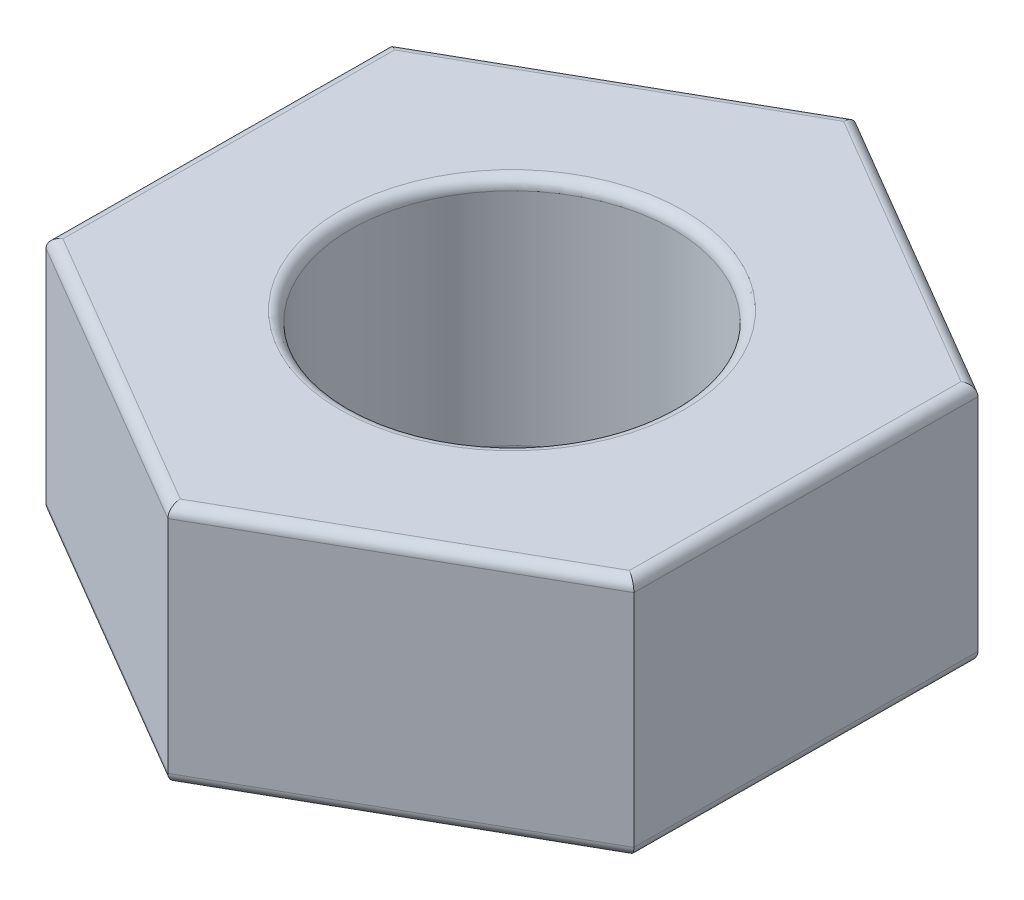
ISO-10303-21;
HEADER;
FILE_DESCRIPTION(('STEP AP214'),'2;1');
FILE_NAME('part.step','',(''),(''),'','','');
FILE_SCHEMA(('AUTOMOTIVE_DESIGN { 1 0 10303 214 1 1 1 1 }'));
ENDSEC;
DATA;
#1=APPLICATION_CONTEXT('core data for automotive mechanical design processes');
#2=APPLICATION_PROTOCOL_DEFINITION('international standard','automotive_design',2000,#1);
#3=PRODUCT_CONTEXT('',#1,'mechanical');
#4=PRODUCT('Part','Part','',(#3));
#5=PRODUCT_RELATED_PRODUCT_CATEGORY('part','',(#4));
#6=PRODUCT_DEFINITION_FORMATION('','',#4);
#7=PRODUCT_DEFINITION_CONTEXT('part definition',#1,'design');
#8=PRODUCT_DEFINITION('design','',#6,#7);
#9=PRODUCT_DEFINITION_SHAPE('','',#8);
#10=(LENGTH_UNIT() NAMED_UNIT(*) SI_UNIT(.MILLI.,.METRE.));
#11=(NAMED_UNIT(*) PLANE_ANGLE_UNIT() SI_UNIT($,.RADIAN.));
#12=(NAMED_UNIT(*) SI_UNIT($,.STERADIAN.) SOLID_ANGLE_UNIT());
#13=UNCERTAINTY_MEASURE_WITH_UNIT(LENGTH_MEASURE(1.E-05),#10,'distance_accuracy_value','');
#14=(GEOMETRIC_REPRESENTATION_CONTEXT(3) GLOBAL_UNCERTAINTY_ASSIGNED_CONTEXT((#13)) GLOBAL_UNIT_ASSIGNED_CONTEXT((#10,
#11,#12)) REPRESENTATION_CONTEXT('',''));
#15=CARTESIAN_POINT('',(0.,0.,0.));
#16=DIRECTION('',(0.,0.,1.));
#17=DIRECTION('',(1.,0.,0.));
#18=AXIS2_PLACEMENT_3D('',#15,#16,#17);
#19=CARTESIAN_POINT('',(0.,2.25,0.));
#20=DIRECTION('',(0.,1.,0.));
#21=DIRECTION('',(0.,0.,1.));
#22=AXIS2_PLACEMENT_3D('',#19,#20,#21);
#23=PLANE('',#22);
#24=CARTESIAN_POINT('',(0.,2.25,0.));
#25=DIRECTION('',(0.,1.,0.));
#26=DIRECTION('',(0.,0.,1.));
#27=AXIS2_PLACEMENT_3D('',#24,#25,#26);
#28=CIRCLE('',#27,1.6);
#29=CARTESIAN_POINT('',(0.,2.25,1.6));
#30=VERTEX_POINT('',#29);
#31=EDGE_CURVE('E11',#30,#30,#28,.F.);
#32=ORIENTED_EDGE('',*,*,#31,.T.);
#33=EDGE_LOOP('',(#32));
#34=FACE_BOUND('',#33,.T.);
#35=DIRECTION('',(-0.00688502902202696,0.,0.999976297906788));
#36=VECTOR('',#35,1.);
#37=CARTESIAN_POINT('',(-2.66086864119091,2.25,1.56943028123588));
#38=LINE('',#37,#36);
#39=CARTESIAN_POINT('',(-2.63940324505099,2.25,-1.54818727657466));
#40=VERTEX_POINT('',#39);
#41=CARTESIAN_POINT('',(-2.66047113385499,2.25,1.51169662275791));
#42=VERTEX_POINT('',#41);
#43=EDGE_CURVE('E51',#40,#42,#38,.T.);
#44=ORIENTED_EDGE('',*,*,#43,.T.);
#45=DIRECTION('',(0.862562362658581,0.,0.505950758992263));
#46=VECTOR('',#45,1.);
#47=CARTESIAN_POINT('',(0.0287321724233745,2.25,3.08909498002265));
#48=LINE('',#47,#46);
#49=CARTESIAN_POINT('',(-0.0210678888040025,2.25,3.05988389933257));
#50=VERTEX_POINT('',#49);
#51=EDGE_CURVE('E43',#42,#50,#48,.T.);
#52=ORIENTED_EDGE('',*,*,#51,.T.);
#53=DIRECTION('',(0.869447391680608,0.,-0.494025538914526));
#54=VECTOR('',#53,1.);
#55=CARTESIAN_POINT('',(2.68960081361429,2.25,1.51966469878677));
#56=LINE('',#55,#54);
#57=CARTESIAN_POINT('',(2.63940324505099,2.25,1.54818727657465));
#58=VERTEX_POINT('',#57);
#59=EDGE_CURVE('E190',#50,#58,#56,.T.);
#60=ORIENTED_EDGE('',*,*,#59,.T.);
#61=DIRECTION('',(0.00688502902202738,0.,-0.999976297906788));
#62=VECTOR('',#61,1.);
#63=CARTESIAN_POINT('',(2.66086864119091,2.25,-1.56943028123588));
#64=LINE('',#63,#62);
#65=CARTESIAN_POINT('',(2.66047113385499,2.25,-1.51169662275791));
#66=VERTEX_POINT('',#65);
#67=EDGE_CURVE('E192',#58,#66,#64,.T.);
#68=ORIENTED_EDGE('',*,*,#67,.T.);
#69=DIRECTION('',(-0.862562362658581,0.,-0.505950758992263));
#70=VECTOR('',#69,1.);
#71=CARTESIAN_POINT('',(-0.0287321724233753,2.25,-3.08909498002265));
#72=LINE('',#71,#70);
#73=CARTESIAN_POINT('',(0.0210678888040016,2.25,-3.05988389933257));
#74=VERTEX_POINT('',#73);
#75=EDGE_CURVE('E194',#66,#74,#72,.T.);
#76=ORIENTED_EDGE('',*,*,#75,.T.);
#77=DIRECTION('',(-0.869447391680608,0.,0.494025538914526));
#78=VECTOR('',#77,1.);
#79=CARTESIAN_POINT('',(-2.68960081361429,2.25,-1.51966469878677));
#80=LINE('',#79,#78);
#81=EDGE_CURVE('E56',#74,#40,#80,.T.);
#82=ORIENTED_EDGE('',*,*,#81,.T.);
#83=EDGE_LOOP('',(#44,#52,#60,#68,#76,#82));
#84=FACE_BOUND('',#83,.T.);
#85=ADVANCED_FACE('F34',(#34,#84),#23,.T.);
#86=CARTESIAN_POINT('',(0.,0.,0.));
#87=DIRECTION('',(0.,1.,0.));
#88=DIRECTION('',(0.,0.,1.));
#89=AXIS2_PLACEMENT_3D('',#86,#87,#88);
#90=PLANE('',#89);
#91=CARTESIAN_POINT('',(0.,0.,0.));
#92=DIRECTION('',(0.,1.,0.));
#93=DIRECTION('',(0.,0.,1.));
#94=AXIS2_PLACEMENT_3D('',#91,#92,#93);
#95=CIRCLE('',#94,1.6);
#96=CARTESIAN_POINT('',(0.,0.,1.6));
#97=VERTEX_POINT('',#96);
#98=EDGE_CURVE('E152',#97,#97,#95,.T.);
#99=ORIENTED_EDGE('',*,*,#98,.T.);
#100=EDGE_LOOP('',(#99));
#101=FACE_BOUND('',#100,.T.);
#102=DIRECTION('',(-0.862562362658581,0.,-0.505950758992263));
#103=VECTOR('',#102,1.);
#104=CARTESIAN_POINT('',(1.3407695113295,0.,-2.28579026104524));
#105=LINE('',#104,#103);
#106=CARTESIAN_POINT('',(0.0210678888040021,0.,-3.05988389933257));
#107=VERTEX_POINT('',#106);
#108=CARTESIAN_POINT('',(2.66047113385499,0.,-1.51169662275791));
#109=VERTEX_POINT('',#108);
#110=EDGE_CURVE('E151',#107,#109,#105,.F.);
#111=ORIENTED_EDGE('',*,*,#110,.T.);
#112=DIRECTION('',(0.00688502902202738,0.,-0.999976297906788));
#113=VECTOR('',#112,1.);
#114=CARTESIAN_POINT('',(2.64993718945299,0.,0.0182453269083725));
#115=LINE('',#114,#113);
#116=CARTESIAN_POINT('',(2.63940324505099,0.,1.54818727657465));
#117=VERTEX_POINT('',#116);
#118=EDGE_CURVE('E130',#109,#117,#115,.F.);
#119=ORIENTED_EDGE('',*,*,#118,.T.);
#120=DIRECTION('',(0.869447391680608,0.,-0.494025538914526));
#121=VECTOR('',#120,1.);
#122=CARTESIAN_POINT('',(1.30916767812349,0.,2.30403558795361));
#123=LINE('',#122,#121);
#124=CARTESIAN_POINT('',(-0.0210678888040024,0.,3.05988389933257));
#125=VERTEX_POINT('',#124);
#126=EDGE_CURVE('E140',#117,#125,#123,.F.);
#127=ORIENTED_EDGE('',*,*,#126,.T.);
#128=DIRECTION('',(0.862562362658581,0.,0.505950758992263));
#129=VECTOR('',#128,1.);
#130=CARTESIAN_POINT('',(-1.3407695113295,0.,2.28579026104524));
#131=LINE('',#130,#129);
#132=CARTESIAN_POINT('',(-2.66047113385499,0.,1.51169662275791));
#133=VERTEX_POINT('',#132);
#134=EDGE_CURVE('E146',#125,#133,#131,.F.);
#135=ORIENTED_EDGE('',*,*,#134,.T.);
#136=DIRECTION('',(-0.00688502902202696,0.,0.999976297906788));
#137=VECTOR('',#136,1.);
#138=CARTESIAN_POINT('',(-2.64993718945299,0.,-0.0182453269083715));
#139=LINE('',#138,#137);
#140=CARTESIAN_POINT('',(-2.63940324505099,0.,-1.54818727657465));
#141=VERTEX_POINT('',#140);
#142=EDGE_CURVE('E252',#133,#141,#139,.F.);
#143=ORIENTED_EDGE('',*,*,#142,.T.);
#144=DIRECTION('',(-0.869447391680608,0.,0.494025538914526));
#145=VECTOR('',#144,1.);
#146=CARTESIAN_POINT('',(-1.30916767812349,0.,-2.30403558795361));
#147=LINE('',#146,#145);
#148=EDGE_CURVE('E157',#141,#107,#147,.F.);
#149=ORIENTED_EDGE('',*,*,#148,.T.);
#150=EDGE_LOOP('',(#111,#119,#127,#135,#143,#149));
#151=FACE_BOUND('',#150,.T.);
#152=ADVANCED_FACE('F149',(#101,#151),#90,.F.);
#153=CARTESIAN_POINT('',(-0.0218629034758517,2.25,3.17535121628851));
#154=DIRECTION('',(-0.494025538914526,0.,-0.869447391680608));
#155=DIRECTION('',(-0.869447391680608,0.,0.494025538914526));
#156=AXIS2_PLACEMENT_3D('',#153,#154,#155);
#157=PLANE('',#156);
#158=DIRECTION('',(0.,-1.,0.));
#159=VECTOR('',#158,1.);
#160=CARTESIAN_POINT('',(-0.0218629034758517,2.25,3.17535121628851));
#161=LINE('',#160,#159);
#162=CARTESIAN_POINT('',(-0.0218629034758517,2.15,3.17535121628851));
#163=VERTEX_POINT('',#162);
#164=CARTESIAN_POINT('',(-0.0218629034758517,0.0999999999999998,3.17535121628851));
#165=VERTEX_POINT('',#164);
#166=EDGE_CURVE('E209',#163,#165,#161,.T.);
#167=ORIENTED_EDGE('',*,*,#166,.T.);
#168=DIRECTION('',(0.869447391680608,0.,-0.494025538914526));
#169=VECTOR('',#168,1.);
#170=CARTESIAN_POINT('',(-0.0218629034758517,0.0999999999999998,3.17535121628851));
#171=LINE('',#170,#169);
#172=CARTESIAN_POINT('',(2.73900336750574,0.0999999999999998,1.60660943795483));
#173=VERTEX_POINT('',#172);
#174=EDGE_CURVE('E188',#165,#173,#171,.T.);
#175=ORIENTED_EDGE('',*,*,#174,.T.);
#176=DIRECTION('',(0.,-1.,0.));
#177=VECTOR('',#176,1.);
#178=CARTESIAN_POINT('',(2.73900336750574,2.25,1.60660943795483));
#179=LINE('',#178,#177);
#180=CARTESIAN_POINT('',(2.73900336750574,2.15,1.60660943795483));
#181=VERTEX_POINT('',#180);
#182=EDGE_CURVE('E147',#181,#173,#179,.T.);
#183=ORIENTED_EDGE('',*,*,#182,.F.);
#184=DIRECTION('',(0.869447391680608,0.,-0.494025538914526));
#185=VECTOR('',#184,1.);
#186=CARTESIAN_POINT('',(-0.0218629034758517,2.15,3.17535121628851));
#187=LINE('',#186,#185);
#188=EDGE_CURVE('E186',#181,#163,#187,.F.);
#189=ORIENTED_EDGE('',*,*,#188,.T.);
#190=EDGE_LOOP('',(#167,#175,#183,#189));
#191=FACE_BOUND('',#190,.T.);
#192=ADVANCED_FACE('F276',(#191),#157,.F.);
#193=CARTESIAN_POINT('',(2.73900336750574,2.25,1.60660943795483));
#194=DIRECTION('',(-0.999976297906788,0.,-0.00688502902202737));
#195=DIRECTION('',(-0.00688502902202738,0.,0.999976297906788));
#196=AXIS2_PLACEMENT_3D('',#193,#194,#195);
#197=PLANE('',#196);
#198=ORIENTED_EDGE('',*,*,#182,.T.);
#199=DIRECTION('',(0.00688502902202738,0.,-0.999976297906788));
#200=VECTOR('',#199,1.);
#201=CARTESIAN_POINT('',(2.73900336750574,0.0999999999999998,1.60660943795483));
#202=LINE('',#201,#200);
#203=CARTESIAN_POINT('',(2.76086627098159,0.0999999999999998,-1.56874177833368));
#204=VERTEX_POINT('',#203);
#205=EDGE_CURVE('E133',#173,#204,#202,.T.);
#206=ORIENTED_EDGE('',*,*,#205,.T.);
#207=DIRECTION('',(0.,-1.,0.));
#208=VECTOR('',#207,1.);
#209=CARTESIAN_POINT('',(2.76086627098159,2.25,-1.56874177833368));
#210=LINE('',#209,#208);
#211=CARTESIAN_POINT('',(2.76086627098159,2.15,-1.56874177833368));
#212=VERTEX_POINT('',#211);
#213=EDGE_CURVE('E238',#212,#204,#210,.T.);
#214=ORIENTED_EDGE('',*,*,#213,.F.);
#215=DIRECTION('',(0.00688502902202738,0.,-0.999976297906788));
#216=VECTOR('',#215,1.);
#217=CARTESIAN_POINT('',(2.73900336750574,2.15,1.60660943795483));
#218=LINE('',#217,#216);
#219=EDGE_CURVE('E166',#212,#181,#218,.F.);
#220=ORIENTED_EDGE('',*,*,#219,.T.);
#221=EDGE_LOOP('',(#198,#206,#214,#220));
#222=FACE_BOUND('',#221,.T.);
#223=ADVANCED_FACE('F243',(#222),#197,.F.);
#224=CARTESIAN_POINT('',(2.76086627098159,2.25,-1.56874177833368));
#225=DIRECTION('',(-0.505950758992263,0.,0.862562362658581));
#226=DIRECTION('',(0.862562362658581,0.,0.505950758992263));
#227=AXIS2_PLACEMENT_3D('',#224,#225,#226);
#228=PLANE('',#227);
#229=ORIENTED_EDGE('',*,*,#213,.T.);
#230=DIRECTION('',(-0.862562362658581,0.,-0.505950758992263));
#231=VECTOR('',#230,1.);
#232=CARTESIAN_POINT('',(2.76086627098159,0.0999999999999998,-1.56874177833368));
#233=LINE('',#232,#231);
#234=CARTESIAN_POINT('',(0.0218629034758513,0.0999999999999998,-3.17535121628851));
#235=VERTEX_POINT('',#234);
#236=EDGE_CURVE('E171',#204,#235,#233,.T.);
#237=ORIENTED_EDGE('',*,*,#236,.T.);
#238=DIRECTION('',(0.,-1.,0.));
#239=VECTOR('',#238,1.);
#240=CARTESIAN_POINT('',(0.0218629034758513,2.25,-3.17535121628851));
#241=LINE('',#240,#239);
#242=CARTESIAN_POINT('',(0.0218629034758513,2.15,-3.17535121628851));
#243=VERTEX_POINT('',#242);
#244=EDGE_CURVE('E240',#243,#235,#241,.T.);
#245=ORIENTED_EDGE('',*,*,#244,.F.);
#246=DIRECTION('',(-0.862562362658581,0.,-0.505950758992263));
#247=VECTOR('',#246,1.);
#248=CARTESIAN_POINT('',(2.76086627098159,2.15,-1.56874177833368));
#249=LINE('',#248,#247);
#250=EDGE_CURVE('E169',#243,#212,#249,.F.);
#251=ORIENTED_EDGE('',*,*,#250,.T.);
#252=EDGE_LOOP('',(#229,#237,#245,#251));
#253=FACE_BOUND('',#252,.T.);
#254=ADVANCED_FACE('F237',(#253),#228,.F.);
#255=CARTESIAN_POINT('',(0.0218629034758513,2.25,-3.17535121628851));
#256=DIRECTION('',(0.494025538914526,0.,0.869447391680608));
#257=DIRECTION('',(0.869447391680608,0.,-0.494025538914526));
#258=AXIS2_PLACEMENT_3D('',#255,#256,#257);
#259=PLANE('',#258);
#260=ORIENTED_EDGE('',*,*,#244,.T.);
#261=DIRECTION('',(-0.869447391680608,0.,0.494025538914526));
#262=VECTOR('',#261,1.);
#263=CARTESIAN_POINT('',(0.0218629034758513,0.0999999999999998,-3.17535121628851));
#264=LINE('',#263,#262);
#265=CARTESIAN_POINT('',(-2.73900336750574,0.0999999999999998,-1.60660943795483));
#266=VERTEX_POINT('',#265);
#267=EDGE_CURVE('E175',#235,#266,#264,.T.);
#268=ORIENTED_EDGE('',*,*,#267,.T.);
#269=DIRECTION('',(0.,-1.,0.));
#270=VECTOR('',#269,1.);
#271=CARTESIAN_POINT('',(-2.73900336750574,2.25,-1.60660943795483));
#272=LINE('',#271,#270);
#273=CARTESIAN_POINT('',(-2.73900336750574,2.15,-1.60660943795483));
#274=VERTEX_POINT('',#273);
#275=EDGE_CURVE('E247',#274,#266,#272,.T.);
#276=ORIENTED_EDGE('',*,*,#275,.F.);
#277=DIRECTION('',(-0.869447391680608,0.,0.494025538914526));
#278=VECTOR('',#277,1.);
#279=CARTESIAN_POINT('',(0.0218629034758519,2.15,-3.17535121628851));
#280=LINE('',#279,#278);
#281=EDGE_CURVE('E173',#274,#243,#280,.F.);
#282=ORIENTED_EDGE('',*,*,#281,.T.);
#283=EDGE_LOOP('',(#260,#268,#276,#282));
#284=FACE_BOUND('',#283,.T.);
#285=ADVANCED_FACE('F264',(#284),#259,.F.);
#286=CARTESIAN_POINT('',(-2.73900336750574,2.25,-1.60660943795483));
#287=DIRECTION('',(0.999976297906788,0.,0.00688502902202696));
#288=DIRECTION('',(0.00688502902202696,0.,-0.999976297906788));
#289=AXIS2_PLACEMENT_3D('',#286,#287,#288);
#290=PLANE('',#289);
#291=ORIENTED_EDGE('',*,*,#275,.T.);
#292=DIRECTION('',(-0.00688502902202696,0.,0.999976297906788));
#293=VECTOR('',#292,1.);
#294=CARTESIAN_POINT('',(-2.73900336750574,0.0999999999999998,-1.60660943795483));
#295=LINE('',#294,#293);
#296=CARTESIAN_POINT('',(-2.76086627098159,0.0999999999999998,1.56874177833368));
#297=VERTEX_POINT('',#296);
#298=EDGE_CURVE('E179',#266,#297,#295,.T.);
#299=ORIENTED_EDGE('',*,*,#298,.T.);
#300=DIRECTION('',(0.,-1.,0.));
#301=VECTOR('',#300,1.);
#302=CARTESIAN_POINT('',(-2.76086627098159,2.25,1.56874177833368));
#303=LINE('',#302,#301);
#304=CARTESIAN_POINT('',(-2.76086627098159,2.15,1.56874177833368));
#305=VERTEX_POINT('',#304);
#306=EDGE_CURVE('E269',#305,#297,#303,.T.);
#307=ORIENTED_EDGE('',*,*,#306,.F.);
#308=DIRECTION('',(-0.00688502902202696,0.,0.999976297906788));
#309=VECTOR('',#308,1.);
#310=CARTESIAN_POINT('',(-2.73900336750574,2.15,-1.60660943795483));
#311=LINE('',#310,#309);
#312=EDGE_CURVE('E177',#305,#274,#311,.F.);
#313=ORIENTED_EDGE('',*,*,#312,.T.);
#314=EDGE_LOOP('',(#291,#299,#307,#313));
#315=FACE_BOUND('',#314,.T.);
#316=ADVANCED_FACE('F287',(#315),#290,.F.);
#317=CARTESIAN_POINT('',(-2.76086627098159,2.25,1.56874177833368));
#318=DIRECTION('',(0.505950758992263,0.,-0.862562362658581));
#319=DIRECTION('',(-0.862562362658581,0.,-0.505950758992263));
#320=AXIS2_PLACEMENT_3D('',#317,#318,#319);
#321=PLANE('',#320);
#322=ORIENTED_EDGE('',*,*,#306,.T.);
#323=DIRECTION('',(0.862562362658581,0.,0.505950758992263));
#324=VECTOR('',#323,1.);
#325=CARTESIAN_POINT('',(-2.76086627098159,0.0999999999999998,1.56874177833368));
#326=LINE('',#325,#324);
#327=EDGE_CURVE('E184',#297,#165,#326,.T.);
#328=ORIENTED_EDGE('',*,*,#327,.T.);
#329=ORIENTED_EDGE('',*,*,#166,.F.);
#330=DIRECTION('',(0.862562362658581,0.,0.505950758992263));
#331=VECTOR('',#330,1.);
#332=CARTESIAN_POINT('',(-2.76086627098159,2.15,1.56874177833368));
#333=LINE('',#332,#331);
#334=EDGE_CURVE('E181',#163,#305,#333,.F.);
#335=ORIENTED_EDGE('',*,*,#334,.T.);
#336=EDGE_LOOP('',(#322,#328,#329,#335));
#337=FACE_BOUND('',#336,.T.);
#338=ADVANCED_FACE('F288',(#337),#321,.F.);
#339=CARTESIAN_POINT('',(0.,2.25,0.));
#340=DIRECTION('',(0.,-1.,0.));
#341=DIRECTION('',(0.,0.,-1.));
#342=AXIS2_PLACEMENT_3D('',#339,#340,#341);
#343=CYLINDRICAL_SURFACE('',#342,1.5);
#344=CARTESIAN_POINT('',(0.,0.0999999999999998,0.));
#345=DIRECTION('',(0.,1.,0.));
#346=DIRECTION('',(0.,0.,1.));
#347=AXIS2_PLACEMENT_3D('',#344,#345,#346);
#348=CIRCLE('',#347,1.5);
#349=CARTESIAN_POINT('',(0.,0.0999999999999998,1.5));
#350=VERTEX_POINT('',#349);
#351=EDGE_CURVE('E163',#350,#350,#348,.F.);
#352=ORIENTED_EDGE('',*,*,#351,.T.);
#353=EDGE_LOOP('',(#352));
#354=FACE_BOUND('',#353,.T.);
#355=CARTESIAN_POINT('',(0.,2.15,0.));
#356=DIRECTION('',(0.,1.,0.));
#357=DIRECTION('',(0.,0.,1.));
#358=AXIS2_PLACEMENT_3D('',#355,#356,#357);
#359=CIRCLE('',#358,1.5);
#360=CARTESIAN_POINT('',(0.,2.15,1.5));
#361=VERTEX_POINT('',#360);
#362=EDGE_CURVE('E155',#361,#361,#359,.T.);
#363=ORIENTED_EDGE('',*,*,#362,.T.);
#364=EDGE_LOOP('',(#363));
#365=FACE_BOUND('',#364,.T.);
#366=ADVANCED_FACE('F307',(#354,#365),#343,.F.);
#367=CARTESIAN_POINT('',(0.,0.0999999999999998,0.));
#368=DIRECTION('',(0.,1.,0.));
#369=DIRECTION('',(0.,0.,1.));
#370=AXIS2_PLACEMENT_3D('',#367,#368,#369);
#371=TOROIDAL_SURFACE('',#370,1.6,0.1);
#372=ORIENTED_EDGE('',*,*,#351,.F.);
#373=EDGE_LOOP('',(#372));
#374=FACE_BOUND('',#373,.T.);
#375=ORIENTED_EDGE('',*,*,#98,.F.);
#376=EDGE_LOOP('',(#375));
#377=FACE_BOUND('',#376,.T.);
#378=ADVANCED_FACE('F321',(#374,#377),#371,.T.);
#379=CARTESIAN_POINT('',(-2.63900573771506,0.0999999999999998,-1.60592093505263));
#380=DIRECTION('',(-0.00688502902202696,0.,0.999976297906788));
#381=DIRECTION('',(0.999976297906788,0.,0.00688502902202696));
#382=AXIS2_PLACEMENT_3D('',#379,#380,#381);
#383=CYLINDRICAL_SURFACE('',#382,0.1);
#384=CARTESIAN_POINT('',(-2.63940324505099,0.0999999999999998,-1.54818727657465));
#385=DIRECTION('',(-0.505950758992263,0.,0.862562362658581));
#386=DIRECTION('',(0.862562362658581,0.,0.505950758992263));
#387=AXIS2_PLACEMENT_3D('',#384,#385,#386);
#388=ELLIPSE('',#387,0.115470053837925,0.1);
#389=EDGE_CURVE('E203',#141,#266,#388,.F.);
#390=ORIENTED_EDGE('',*,*,#389,.F.);
#391=ORIENTED_EDGE('',*,*,#142,.F.);
#392=CARTESIAN_POINT('',(-2.66047113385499,0.0999999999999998,1.51169662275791));
#393=DIRECTION('',(0.494025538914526,0.,0.869447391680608));
#394=DIRECTION('',(0.869447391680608,0.,-0.494025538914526));
#395=AXIS2_PLACEMENT_3D('',#392,#393,#394);
#396=ELLIPSE('',#395,0.115470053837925,0.1);
#397=EDGE_CURVE('E206',#297,#133,#396,.T.);
#398=ORIENTED_EDGE('',*,*,#397,.F.);
#399=ORIENTED_EDGE('',*,*,#298,.F.);
#400=EDGE_LOOP('',(#390,#391,#398,#399));
#401=FACE_BOUND('',#400,.T.);
#402=ADVANCED_FACE('F285',(#401),#383,.T.);
#403=CARTESIAN_POINT('',(-2.71027119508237,0.0999999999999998,1.48248554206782));
#404=DIRECTION('',(0.862562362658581,0.,0.505950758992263));
#405=DIRECTION('',(0.505950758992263,0.,-0.862562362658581));
#406=AXIS2_PLACEMENT_3D('',#403,#404,#405);
#407=CYLINDRICAL_SURFACE('',#406,0.1);
#408=ORIENTED_EDGE('',*,*,#397,.T.);
#409=ORIENTED_EDGE('',*,*,#134,.F.);
#410=CARTESIAN_POINT('',(-0.0210678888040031,0.0999999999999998,3.05988389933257));
#411=DIRECTION('',(0.999976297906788,0.,0.00688502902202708));
#412=DIRECTION('',(0.00688502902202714,0.,-0.999976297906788));
#413=AXIS2_PLACEMENT_3D('',#410,#411,#412);
#414=ELLIPSE('',#413,0.115470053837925,0.1);
#415=EDGE_CURVE('E143',#165,#125,#414,.T.);
#416=ORIENTED_EDGE('',*,*,#415,.F.);
#417=ORIENTED_EDGE('',*,*,#327,.F.);
#418=EDGE_LOOP('',(#408,#409,#416,#417));
#419=FACE_BOUND('',#418,.T.);
#420=ADVANCED_FACE('F282',(#419),#407,.T.);
#421=CARTESIAN_POINT('',(0.0712654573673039,0.0999999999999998,-3.08840647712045));
#422=DIRECTION('',(-0.869447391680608,0.,0.494025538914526));
#423=DIRECTION('',(0.494025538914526,0.,0.869447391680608));
#424=AXIS2_PLACEMENT_3D('',#421,#422,#423);
#425=CYLINDRICAL_SURFACE('',#424,0.1);
#426=ORIENTED_EDGE('',*,*,#389,.T.);
#427=ORIENTED_EDGE('',*,*,#267,.F.);
#428=CARTESIAN_POINT('',(0.0210678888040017,0.0999999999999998,-3.05988389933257));
#429=DIRECTION('',(-0.999976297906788,0.,-0.00688502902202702));
#430=DIRECTION('',(-0.00688502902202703,0.,0.999976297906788));
#431=AXIS2_PLACEMENT_3D('',#428,#429,#430);
#432=ELLIPSE('',#431,0.115470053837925,0.1);
#433=EDGE_CURVE('E136',#107,#235,#432,.F.);
#434=ORIENTED_EDGE('',*,*,#433,.F.);
#435=ORIENTED_EDGE('',*,*,#148,.F.);
#436=EDGE_LOOP('',(#426,#427,#434,#435));
#437=FACE_BOUND('',#436,.T.);
#438=ADVANCED_FACE('F259',(#437),#425,.T.);
#439=CARTESIAN_POINT('',(-0.0712654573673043,0.0999999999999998,3.08840647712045));
#440=DIRECTION('',(0.869447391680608,0.,-0.494025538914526));
#441=DIRECTION('',(-0.494025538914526,0.,-0.869447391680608));
#442=AXIS2_PLACEMENT_3D('',#439,#440,#441);
#443=CYLINDRICAL_SURFACE('',#442,0.1);
#444=ORIENTED_EDGE('',*,*,#415,.T.);
#445=ORIENTED_EDGE('',*,*,#126,.F.);
#446=CARTESIAN_POINT('',(2.63940324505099,0.0999999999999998,1.54818727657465));
#447=DIRECTION('',(0.505950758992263,0.,-0.862562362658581));
#448=DIRECTION('',(0.862562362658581,0.,0.505950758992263));
#449=AXIS2_PLACEMENT_3D('',#446,#447,#448);
#450=ELLIPSE('',#449,0.115470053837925,0.1);
#451=EDGE_CURVE('E126',#173,#117,#450,.T.);
#452=ORIENTED_EDGE('',*,*,#451,.F.);
#453=ORIENTED_EDGE('',*,*,#174,.F.);
#454=EDGE_LOOP('',(#444,#445,#452,#453));
#455=FACE_BOUND('',#454,.T.);
#456=ADVANCED_FACE('F141',(#455),#443,.T.);
#457=CARTESIAN_POINT('',(2.71027119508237,0.0999999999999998,-1.48248554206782));
#458=DIRECTION('',(-0.862562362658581,0.,-0.505950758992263));
#459=DIRECTION('',(-0.505950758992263,0.,0.862562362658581));
#460=AXIS2_PLACEMENT_3D('',#457,#458,#459);
#461=CYLINDRICAL_SURFACE('',#460,0.1);
#462=ORIENTED_EDGE('',*,*,#433,.T.);
#463=ORIENTED_EDGE('',*,*,#236,.F.);
#464=CARTESIAN_POINT('',(2.66047113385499,0.0999999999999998,-1.51169662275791));
#465=DIRECTION('',(-0.494025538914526,0.,-0.869447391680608));
#466=DIRECTION('',(-0.869447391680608,0.,0.494025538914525));
#467=AXIS2_PLACEMENT_3D('',#464,#465,#466);
#468=ELLIPSE('',#467,0.115470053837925,0.1);
#469=EDGE_CURVE('E137',#109,#204,#468,.F.);
#470=ORIENTED_EDGE('',*,*,#469,.F.);
#471=ORIENTED_EDGE('',*,*,#110,.F.);
#472=EDGE_LOOP('',(#462,#463,#470,#471));
#473=FACE_BOUND('',#472,.T.);
#474=ADVANCED_FACE('F262',(#473),#461,.T.);
#475=CARTESIAN_POINT('',(2.63900573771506,0.0999999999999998,1.60592093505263));
#476=DIRECTION('',(0.00688502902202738,0.,-0.999976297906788));
#477=DIRECTION('',(-0.999976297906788,0.,-0.00688502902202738));
#478=AXIS2_PLACEMENT_3D('',#475,#476,#477);
#479=CYLINDRICAL_SURFACE('',#478,0.1);
#480=ORIENTED_EDGE('',*,*,#451,.T.);
#481=ORIENTED_EDGE('',*,*,#118,.F.);
#482=ORIENTED_EDGE('',*,*,#469,.T.);
#483=ORIENTED_EDGE('',*,*,#205,.F.);
#484=EDGE_LOOP('',(#480,#481,#482,#483));
#485=FACE_BOUND('',#484,.T.);
#486=ADVANCED_FACE('F128',(#485),#479,.T.);
#487=CARTESIAN_POINT('',(0.,2.15,0.));
#488=DIRECTION('',(0.,1.,0.));
#489=DIRECTION('',(0.,0.,1.));
#490=AXIS2_PLACEMENT_3D('',#487,#488,#489);
#491=TOROIDAL_SURFACE('',#490,1.6,0.1);
#492=ORIENTED_EDGE('',*,*,#31,.F.);
#493=EDGE_LOOP('',(#492));
#494=FACE_BOUND('',#493,.T.);
#495=ORIENTED_EDGE('',*,*,#362,.F.);
#496=EDGE_LOOP('',(#495));
#497=FACE_BOUND('',#496,.T.);
#498=ADVANCED_FACE('F327',(#494,#497),#491,.T.);
#499=CARTESIAN_POINT('',(1.3407695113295,2.15,-2.28579026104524));
#500=DIRECTION('',(0.862562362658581,0.,0.505950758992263));
#501=DIRECTION('',(0.505950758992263,0.,-0.862562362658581));
#502=AXIS2_PLACEMENT_3D('',#499,#500,#501);
#503=CYLINDRICAL_SURFACE('',#502,0.1);
#504=CARTESIAN_POINT('',(2.66047113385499,2.15,-1.51169662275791));
#505=DIRECTION('',(0.494025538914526,0.,0.869447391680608));
#506=DIRECTION('',(-0.869447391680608,0.,0.494025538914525));
#507=AXIS2_PLACEMENT_3D('',#504,#505,#506);
#508=ELLIPSE('',#507,0.115470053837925,0.1);
#509=EDGE_CURVE('E219',#212,#66,#508,.T.);
#510=ORIENTED_EDGE('',*,*,#509,.F.);
#511=ORIENTED_EDGE('',*,*,#250,.F.);
#512=CARTESIAN_POINT('',(0.0210678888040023,2.15,-3.05988389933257));
#513=DIRECTION('',(0.999976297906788,0.,0.00688502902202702));
#514=DIRECTION('',(-0.00688502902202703,0.,0.999976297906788));
#515=AXIS2_PLACEMENT_3D('',#512,#513,#514);
#516=ELLIPSE('',#515,0.115470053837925,0.1);
#517=EDGE_CURVE('E38',#74,#243,#516,.F.);
#518=ORIENTED_EDGE('',*,*,#517,.F.);
#519=ORIENTED_EDGE('',*,*,#75,.F.);
#520=EDGE_LOOP('',(#510,#511,#518,#519));
#521=FACE_BOUND('',#520,.T.);
#522=ADVANCED_FACE('F36',(#521),#503,.T.);
#523=CARTESIAN_POINT('',(-1.30916767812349,2.15,-2.30403558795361));
#524=DIRECTION('',(0.869447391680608,0.,-0.494025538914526));
#525=DIRECTION('',(-0.494025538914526,0.,-0.869447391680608));
#526=AXIS2_PLACEMENT_3D('',#523,#524,#525);
#527=CYLINDRICAL_SURFACE('',#526,0.1);
#528=ORIENTED_EDGE('',*,*,#517,.T.);
#529=ORIENTED_EDGE('',*,*,#281,.F.);
#530=CARTESIAN_POINT('',(-2.63940324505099,2.15,-1.54818727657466));
#531=DIRECTION('',(0.505950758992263,0.,-0.862562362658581));
#532=DIRECTION('',(0.862562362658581,0.,0.505950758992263));
#533=AXIS2_PLACEMENT_3D('',#530,#531,#532);
#534=ELLIPSE('',#533,0.115470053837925,0.1);
#535=EDGE_CURVE('E217',#40,#274,#534,.F.);
#536=ORIENTED_EDGE('',*,*,#535,.F.);
#537=ORIENTED_EDGE('',*,*,#81,.F.);
#538=EDGE_LOOP('',(#528,#529,#536,#537));
#539=FACE_BOUND('',#538,.T.);
#540=ADVANCED_FACE('F229',(#539),#527,.T.);
#541=CARTESIAN_POINT('',(2.64993718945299,2.15,0.0182453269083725));
#542=DIRECTION('',(-0.00688502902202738,0.,0.999976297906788));
#543=DIRECTION('',(0.999976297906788,0.,0.00688502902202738));
#544=AXIS2_PLACEMENT_3D('',#541,#542,#543);
#545=CYLINDRICAL_SURFACE('',#544,0.1);
#546=ORIENTED_EDGE('',*,*,#509,.T.);
#547=ORIENTED_EDGE('',*,*,#67,.F.);
#548=CARTESIAN_POINT('',(2.63940324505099,2.15,1.54818727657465));
#549=DIRECTION('',(-0.505950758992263,0.,0.862562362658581));
#550=DIRECTION('',(-0.862562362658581,0.,-0.505950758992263));
#551=AXIS2_PLACEMENT_3D('',#548,#549,#550);
#552=ELLIPSE('',#551,0.115470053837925,0.1);
#553=EDGE_CURVE('E214',#181,#58,#552,.T.);
#554=ORIENTED_EDGE('',*,*,#553,.F.);
#555=ORIENTED_EDGE('',*,*,#219,.F.);
#556=EDGE_LOOP('',(#546,#547,#554,#555));
#557=FACE_BOUND('',#556,.T.);
#558=ADVANCED_FACE('F348',(#557),#545,.T.);
#559=CARTESIAN_POINT('',(-2.64993718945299,2.15,-0.0182453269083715));
#560=DIRECTION('',(0.00688502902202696,0.,-0.999976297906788));
#561=DIRECTION('',(-0.999976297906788,0.,-0.00688502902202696));
#562=AXIS2_PLACEMENT_3D('',#559,#560,#561);
#563=CYLINDRICAL_SURFACE('',#562,0.1);
#564=ORIENTED_EDGE('',*,*,#535,.T.);
#565=ORIENTED_EDGE('',*,*,#312,.F.);
#566=CARTESIAN_POINT('',(-2.66047113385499,2.15,1.51169662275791));
#567=DIRECTION('',(-0.494025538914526,0.,-0.869447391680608));
#568=DIRECTION('',(0.869447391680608,0.,-0.494025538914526));
#569=AXIS2_PLACEMENT_3D('',#566,#567,#568);
#570=ELLIPSE('',#569,0.115470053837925,0.1);
#571=EDGE_CURVE('E212',#42,#305,#570,.F.);
#572=ORIENTED_EDGE('',*,*,#571,.F.);
#573=ORIENTED_EDGE('',*,*,#43,.F.);
#574=EDGE_LOOP('',(#564,#565,#572,#573));
#575=FACE_BOUND('',#574,.T.);
#576=ADVANCED_FACE('F345',(#575),#563,.T.);
#577=CARTESIAN_POINT('',(1.30916767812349,2.15,2.30403558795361));
#578=DIRECTION('',(-0.869447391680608,0.,0.494025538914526));
#579=DIRECTION('',(0.494025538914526,0.,0.869447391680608));
#580=AXIS2_PLACEMENT_3D('',#577,#578,#579);
#581=CYLINDRICAL_SURFACE('',#580,0.1);
#582=ORIENTED_EDGE('',*,*,#553,.T.);
#583=ORIENTED_EDGE('',*,*,#59,.F.);
#584=CARTESIAN_POINT('',(-0.0210678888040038,2.15,3.05988389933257));
#585=DIRECTION('',(-0.999976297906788,0.,-0.00688502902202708));
#586=DIRECTION('',(-0.00688502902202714,0.,0.999976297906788));
#587=AXIS2_PLACEMENT_3D('',#584,#585,#586);
#588=ELLIPSE('',#587,0.115470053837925,0.1);
#589=EDGE_CURVE('E210',#163,#50,#588,.T.);
#590=ORIENTED_EDGE('',*,*,#589,.F.);
#591=ORIENTED_EDGE('',*,*,#188,.F.);
#592=EDGE_LOOP('',(#582,#583,#590,#591));
#593=FACE_BOUND('',#592,.T.);
#594=ADVANCED_FACE('F296',(#593),#581,.T.);
#595=CARTESIAN_POINT('',(-1.3407695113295,2.15,2.28579026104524));
#596=DIRECTION('',(-0.862562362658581,0.,-0.505950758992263));
#597=DIRECTION('',(-0.505950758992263,0.,0.862562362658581));
#598=AXIS2_PLACEMENT_3D('',#595,#596,#597);
#599=CYLINDRICAL_SURFACE('',#598,0.1);
#600=ORIENTED_EDGE('',*,*,#571,.T.);
#601=ORIENTED_EDGE('',*,*,#334,.F.);
#602=ORIENTED_EDGE('',*,*,#589,.T.);
#603=ORIENTED_EDGE('',*,*,#51,.F.);
#604=EDGE_LOOP('',(#600,#601,#602,#603));
#605=FACE_BOUND('',#604,.T.);
#606=ADVANCED_FACE('F291',(#605),#599,.T.);
#607=CLOSED_SHELL('',(#85,#152,#192,#223,#254,#285,#316,#338,#366,#378,#402,#420,#438,#456,#474,
#486,#498,#522,#540,#558,#576,#594,#606));
#608=MANIFOLD_SOLID_BREP('B2',#607);
#609=ADVANCED_BREP_SHAPE_REPRESENTATION('',(#18,#608),#14);
#610=SHAPE_DEFINITION_REPRESENTATION(#9,#609);
ENDSEC;
END-ISO-10303-21;
